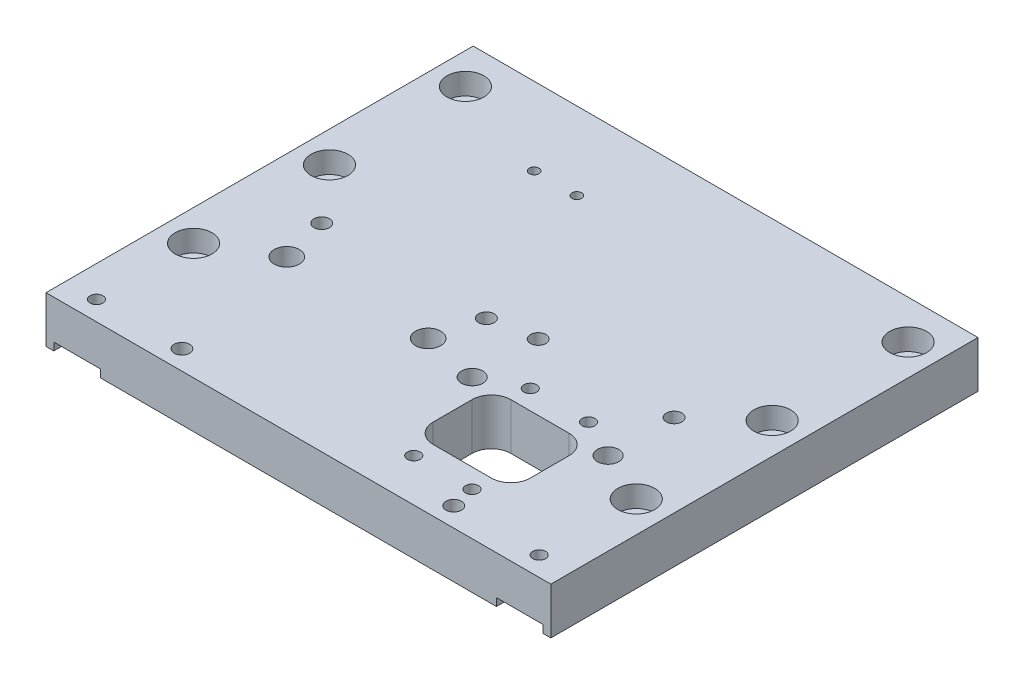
from build123d import *

# Parameters (mm, degrees)
EXTRUDE_1_DEPTH     = 110
SKETCH_2_R          = 3.25
SKETCH_2_R_2        = 2
SKETCH_2_R_3        = 2.75
SKETCH_2_R_4        = 1.25
SKETCH_2_R_5        = 1.65
CUT_EXTRUDE_1_DEPTH = 110
SKETCH_3_R          = 4.75
CUT_EXTRUDE_2_DEPTH = 5.5
SKETCH_5_R          = 5.5
SKETCH_5_R_2        = 4.75
CUT_EXTRUDE_3_DEPTH = 6.5


with BuildPart() as part:
    # Sketch 1 → Extrude 1 (new body)
    with BuildSketch(Plane.XY):
        Polygon((0, 12), (130, 12), (130, 0), (128, 0), (128, 2), (116, 2), (116, 0), (14, 0), (14, 2), (2, 2), (2, 0), (0, 0), align=None)
    extrude(amount=EXTRUDE_1_DEPTH)

    # Sketch 2 → Cut-Extrude 1 (cut)
    with BuildSketch(Plane(origin=(0, 12, 0), x_dir=(1, 0, 0), z_dir=(0, 1, 0))):
        with Locations(Location((23, -71, 0), (0, 0, 270))):
            Circle(SKETCH_2_R)
        with Locations(Location((59.4, -71, 0), (0, 0, 270))):
            Circle(SKETCH_2_R)
        with Locations(Location((20, -59, 0), (0, 0, 270))):
            Circle(SKETCH_2_R_2)
        with Locations(Location((62.4, -59, 0), (0, 0, 270))):
            Circle(SKETCH_2_R_2)
        with Locations(Location((73.7, -73.96, 0), (0, 0, 270))):
            Circle(SKETCH_2_R_3)
        with Locations(Location((108.7, -73.96, 0), (0, 0, 270))):
            Circle(SKETCH_2_R_3)
        with Locations(Location((108.7, -56.96, 0), (0, 0, 270))):
            Circle(SKETCH_2_R_2)
        with Locations(Location((73.7, -56.96, 0), (0, 0, 270))):
            Circle(SKETCH_2_R_2)
        with Locations(Location((35.7, -20, 0), (0, 0, 270))):
            Circle(SKETCH_2_R_4)
        with Locations(Location((46.7, -20, 0), (0, 0, 270))):
            Circle(SKETCH_2_R_4)
        with Locations(Location((8, -105, 0), (0, 0, 270))):
            Circle(SKETCH_2_R_5)
        with Locations(Location((122, -105, 0), (0, 0, 270))):
            Circle(SKETCH_2_R_5)
        with Locations(Location((30, -105, 0), (0, 0, 270))):
            Circle(SKETCH_2_R_2)
        with Locations(Location((100, -105, 0), (0, 0, 270))):
            Circle(SKETCH_2_R_2)
        with Locations(Location((8, -10, 0), (0, 0, 270))):
            Circle(SKETCH_2_R_3)
        with Locations(Location((8, -45, 0), (0, 0, 270))):
            Circle(SKETCH_2_R_3)
        with Locations(Location((8, -80, 0), (0, 0, 270))):
            Circle(SKETCH_2_R_3)
        with Locations(Location((122, -80, 0), (0, 0, 270))):
            Circle(SKETCH_2_R_3)
        with Locations(Location((122, -45, 0), (0, 0, 270))):
            Circle(SKETCH_2_R_3)
        with Locations(Location((122, -10, 0), (0, 0, 270))):
            Circle(SKETCH_2_R_3)
        with Locations(Location((83.7, -69, 0), (0, 0, 270))):
            Circle(SKETCH_2_R_5)
        with Locations(Location((98.7, -69, 0), (0, 0, 270))):
            Circle(SKETCH_2_R_5)
        with Locations(Location((98.7, -99, 0), (0, 0, 270))):
            Circle(SKETCH_2_R_5)
        with Locations(Location((83.7, -99, 0), (0, 0, 270))):
            Circle(SKETCH_2_R_5)
        with BuildLine():
            Line((83.7, -94), (98.7, -94))
            ThreePointArc((98.7, -94), (102.235533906, -92.535533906), (103.7, -89))
            Line((103.7, -89), (103.7, -79))
            ThreePointArc((103.7, -79), (102.235533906, -75.464466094), (98.7, -74))
            Line((98.7, -74), (83.7, -74))
            ThreePointArc((83.7, -74), (80.164466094, -75.464466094), (78.7, -79))
            Line((78.7, -79), (78.7, -89))
            ThreePointArc((78.7, -89), (80.164466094, -92.535533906), (83.7, -94))
        make_face()
    extrude(amount=-CUT_EXTRUDE_1_DEPTH, mode=Mode.SUBTRACT)

    # Sketch 3 → Cut-Extrude 2 (cut)
    with BuildSketch(Plane(origin=(0, 12, 0), x_dir=(1, 0, 0), z_dir=(0, 1, 0))):
        with Locations(Location((8, -10, 0), (0, 0, 270))):
            Circle(SKETCH_3_R)
        with Locations(Location((8, -45, 0), (0, 0, 270))):
            Circle(SKETCH_3_R)
        with Locations(Location((8, -80, 0), (0, 0, 270))):
            Circle(SKETCH_3_R)
        with Locations(Location((122, -80, 0), (0, 0, 270))):
            Circle(SKETCH_3_R)
        with Locations(Location((122, -45, 0), (0, 0, 270))):
            Circle(SKETCH_3_R)
        with Locations(Location((122, -10, 0), (0, 0, 270))):
            Circle(SKETCH_3_R)
    extrude(amount=-CUT_EXTRUDE_2_DEPTH, mode=Mode.SUBTRACT)

    # Sketch 5 → Cut-Extrude 3 (cut)
    with BuildSketch(Plane.XZ):
        with Locations(Location((23, 71, 0), (0, 0, 270))):
            Circle(SKETCH_5_R)
        with Locations(Location((59.4, 71, 0), (0, 0, 270))):
            Circle(SKETCH_5_R)
        with Locations(Location((73.7, 73.96, 0), (0, 0, 270))):
            Circle(SKETCH_5_R_2)
        with Locations(Location((108.7, 73.96, 0), (0, 0, 270))):
            Circle(SKETCH_5_R_2)
    extrude(amount=-CUT_EXTRUDE_3_DEPTH, mode=Mode.SUBTRACT)


solid = part.part
